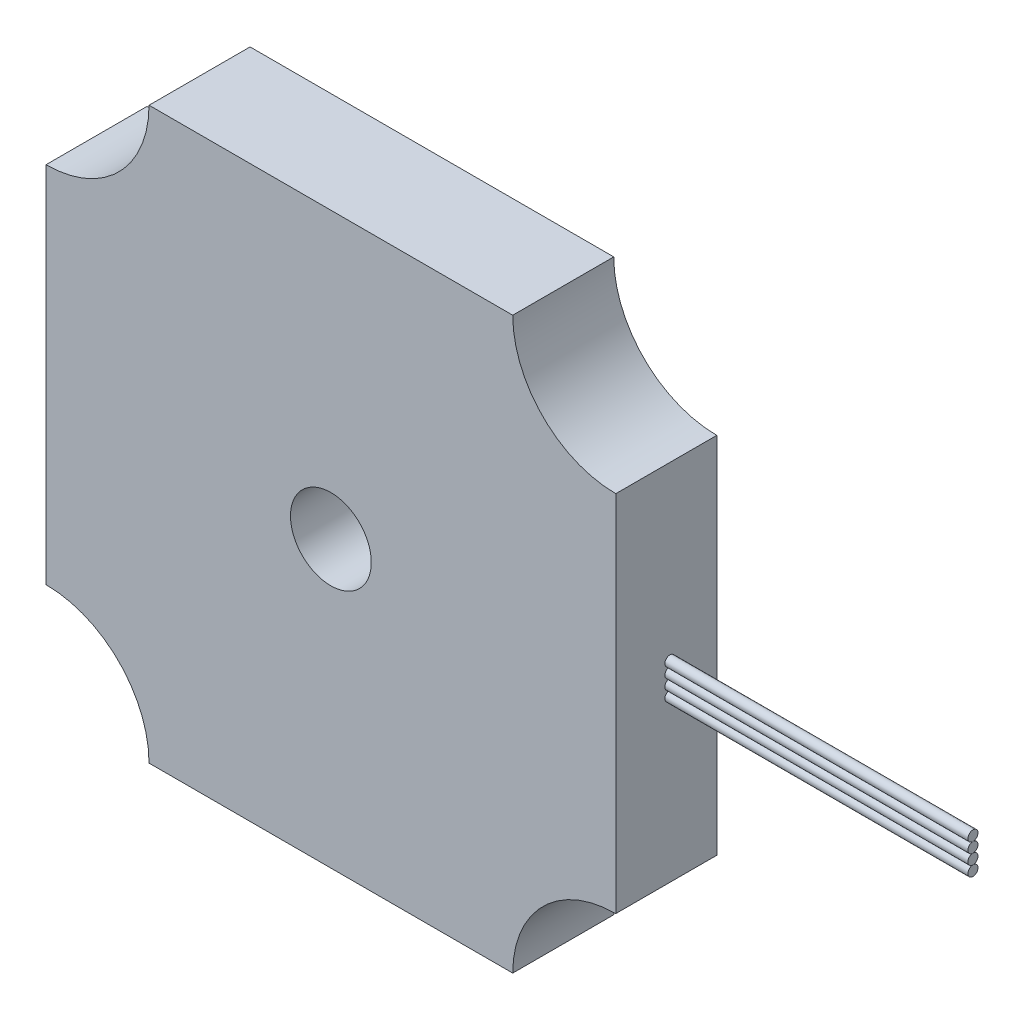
from build123d import *

# Parameters (mm, degrees)
EXTRUDE_1_DEPTH     = 10
SKETCH_2_R          = 4
CUT_EXTRUDE_1_DEPTH = 10
SKETCH_3_R          = 0.5
EXTRUDE_2_DEPTH     = 30
EXTRUDE_2_2_DEPTH   = 30
EXTRUDE_2_3_DEPTH   = 30
EXTRUDE_2_4_DEPTH   = 30


with BuildPart() as part:
    # Sketch 1 → Extrude 1 (new body)
    with BuildSketch(Plane.XY):
        with BuildLine():
            Line((-18, -28.2), (18, -28.2))
            ThreePointArc((18, -28.2), (20.987510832, -20.987510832), (28.2, -18))
            Line((28.2, -18), (28.2, 18))
            ThreePointArc((28.2, 18), (20.987510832, 20.987510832), (18, 28.2))
            Line((18, 28.2), (-18, 28.2))
            ThreePointArc((-18, 28.2), (-20.987510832, 20.987510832), (-28.2, 18))
            Line((-28.2, 18), (-28.2, -18))
            ThreePointArc((-28.2, -18), (-20.987510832, -20.987510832), (-18, -28.2))
        make_face()
    extrude(amount=EXTRUDE_1_DEPTH)

    # Sketch 2 → Cut-Extrude 1 (cut)
    with BuildSketch(Plane(origin=(0, 0, 0), x_dir=(-1, 0, 0), z_dir=(0, 0, -1))):
        Circle(SKETCH_2_R)
    extrude(amount=-CUT_EXTRUDE_1_DEPTH, mode=Mode.SUBTRACT)


with BuildPart() as body_2:
    # Sketch 3 → Extrude 2 (new body)
    with BuildSketch(Plane(origin=(28.2, 0, 0), x_dir=(0, 0, -1), z_dir=(1, 0, 0))):
        with Locations((-4.643448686, 0)):
            Circle(SKETCH_3_R)
    extrude(amount=EXTRUDE_2_DEPTH)


with BuildPart() as body_3:
    # Sketch 3 → Extrude 2 2 (new body)
    with BuildSketch(Plane(origin=(28.2, 0, 0), x_dir=(0, 0, -1), z_dir=(1, 0, 0))):
        with Locations((-4.643448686, 1)):
            Circle(SKETCH_3_R)
    extrude(amount=EXTRUDE_2_2_DEPTH)


with BuildPart() as body_4:
    # Sketch 3 → Extrude 2 3 (new body)
    with BuildSketch(Plane(origin=(28.2, 0, 0), x_dir=(0, 0, -1), z_dir=(1, 0, 0))):
        with Locations((-4.643448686, -1)):
            Circle(SKETCH_3_R)
    extrude(amount=EXTRUDE_2_3_DEPTH)


with BuildPart() as body_5:
    # Sketch 3 → Extrude 2 4 (new body)
    with BuildSketch(Plane(origin=(28.2, 0, 0), x_dir=(0, 0, -1), z_dir=(1, 0, 0))):
        with Locations((-4.643448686, -2)):
            Circle(SKETCH_3_R)
    extrude(amount=EXTRUDE_2_4_DEPTH)


solid = Compound([part.part, body_2.part, body_3.part, body_4.part, body_5.part])
